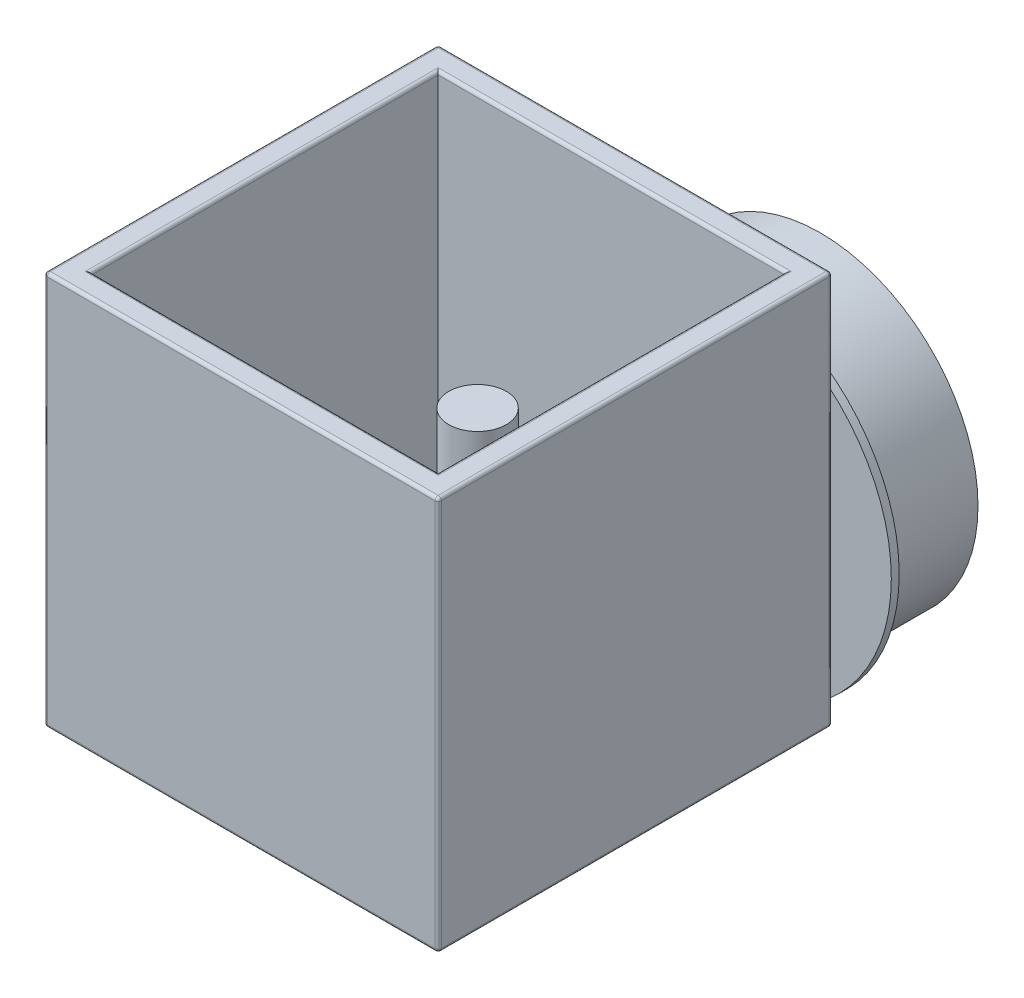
ISO-10303-21;
HEADER;
FILE_DESCRIPTION(('STEP AP214'),'2;1');
FILE_NAME('part.step','',(''),(''),'','','');
FILE_SCHEMA(('AUTOMOTIVE_DESIGN { 1 0 10303 214 1 1 1 1 }'));
ENDSEC;
DATA;
#1=APPLICATION_CONTEXT('core data for automotive mechanical design processes');
#2=APPLICATION_PROTOCOL_DEFINITION('international standard','automotive_design',2000,#1);
#3=PRODUCT_CONTEXT('',#1,'mechanical');
#4=PRODUCT('Part','Part','',(#3));
#5=PRODUCT_RELATED_PRODUCT_CATEGORY('part','',(#4));
#6=PRODUCT_DEFINITION_FORMATION('','',#4);
#7=PRODUCT_DEFINITION_CONTEXT('part definition',#1,'design');
#8=PRODUCT_DEFINITION('design','',#6,#7);
#9=PRODUCT_DEFINITION_SHAPE('','',#8);
#10=(LENGTH_UNIT() NAMED_UNIT(*) SI_UNIT(.MILLI.,.METRE.));
#11=(NAMED_UNIT(*) PLANE_ANGLE_UNIT() SI_UNIT($,.RADIAN.));
#12=(NAMED_UNIT(*) SI_UNIT($,.STERADIAN.) SOLID_ANGLE_UNIT());
#13=UNCERTAINTY_MEASURE_WITH_UNIT(LENGTH_MEASURE(1.E-05),#10,'distance_accuracy_value','');
#14=(GEOMETRIC_REPRESENTATION_CONTEXT(3) GLOBAL_UNCERTAINTY_ASSIGNED_CONTEXT((#13)) GLOBAL_UNIT_ASSIGNED_CONTEXT((#10,
#11,#12)) REPRESENTATION_CONTEXT('',''));
#15=CARTESIAN_POINT('',(0.,0.,0.));
#16=DIRECTION('',(0.,0.,1.));
#17=DIRECTION('',(1.,0.,0.));
#18=AXIS2_PLACEMENT_3D('',#15,#16,#17);
#19=CARTESIAN_POINT('',(-1.01424001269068,51.4911360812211,138.5));
#20=DIRECTION('',(0.,-1.,0.));
#21=DIRECTION('',(0.,0.,-1.));
#22=AXIS2_PLACEMENT_3D('',#19,#20,#21);
#23=CYLINDRICAL_SURFACE('',#22,7.31063902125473);
#24=CARTESIAN_POINT('',(-1.01424001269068,51.4911360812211,138.5));
#25=DIRECTION('',(0.,1.,0.));
#26=DIRECTION('',(0.,0.,1.));
#27=AXIS2_PLACEMENT_3D('',#24,#25,#26);
#28=CIRCLE('',#27,7.31063902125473);
#29=CARTESIAN_POINT('',(-1.01424001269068,51.4911360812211,145.810639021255));
#30=VERTEX_POINT('',#29);
#31=EDGE_CURVE('P0_E10',#30,#30,#28,.T.);
#32=ORIENTED_EDGE('',*,*,#31,.F.);
#33=EDGE_LOOP('',(#32));
#34=FACE_BOUND('',#33,.T.);
#35=CARTESIAN_POINT('',(-1.01424001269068,31.4911360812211,138.5));
#36=DIRECTION('',(0.,1.,0.));
#37=DIRECTION('',(0.,0.,1.));
#38=AXIS2_PLACEMENT_3D('',#35,#36,#37);
#39=CIRCLE('',#38,7.31063902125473);
#40=CARTESIAN_POINT('',(-1.01424001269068,31.4911360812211,145.810639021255));
#41=VERTEX_POINT('',#40);
#42=EDGE_CURVE('P0_E18',#41,#41,#39,.T.);
#43=ORIENTED_EDGE('',*,*,#42,.T.);
#44=EDGE_LOOP('',(#43));
#45=FACE_BOUND('',#44,.T.);
#46=ADVANCED_FACE('P0_F15',(#34,#45),#23,.T.);
#47=CARTESIAN_POINT('',(-1.01424001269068,51.4911360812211,138.5));
#48=DIRECTION('',(0.,1.,0.));
#49=DIRECTION('',(0.,0.,1.));
#50=AXIS2_PLACEMENT_3D('',#47,#48,#49);
#51=PLANE('',#50);
#52=ORIENTED_EDGE('',*,*,#31,.T.);
#53=EDGE_LOOP('',(#52));
#54=FACE_BOUND('',#53,.T.);
#55=ADVANCED_FACE('P0_F30',(#54),#51,.T.);
#56=CARTESIAN_POINT('',(-1.01424001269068,31.4911360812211,138.5));
#57=DIRECTION('',(0.,1.,0.));
#58=DIRECTION('',(0.,0.,1.));
#59=AXIS2_PLACEMENT_3D('',#56,#57,#58);
#60=PLANE('',#59);
#61=ORIENTED_EDGE('',*,*,#42,.F.);
#62=EDGE_LOOP('',(#61));
#63=FACE_BOUND('',#62,.T.);
#64=ADVANCED_FACE('P0_F28',(#63),#60,.F.);
#65=CLOSED_SHELL('',(#46,#55,#64));
#66=MANIFOLD_SOLID_BREP('P0_B1',#65);
#67=CARTESIAN_POINT('',(-1.01424001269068,6.49113608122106,98.5));
#68=DIRECTION('',(0.,0.,-1.));
#69=DIRECTION('',(0.,1.,0.));
#70=AXIS2_PLACEMENT_3D('',#67,#68,#69);
#71=PLANE('',#70);
#72=CARTESIAN_POINT('',(-1.01424001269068,6.49113608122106,98.5));
#73=DIRECTION('',(0.,0.,-1.));
#74=DIRECTION('',(0.,1.,0.));
#75=AXIS2_PLACEMENT_3D('',#72,#73,#74);
#76=CIRCLE('',#75,6.);
#77=CARTESIAN_POINT('',(-1.01424001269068,12.4911360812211,98.5));
#78=VERTEX_POINT('',#77);
#79=EDGE_CURVE('P1_E29',#78,#78,#76,.T.);
#80=ORIENTED_EDGE('',*,*,#79,.T.);
#81=EDGE_LOOP('',(#80));
#82=FACE_BOUND('',#81,.T.);
#83=ADVANCED_FACE('P1_F17',(#82),#71,.T.);
#84=CARTESIAN_POINT('',(-1.01424001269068,31.4911360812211,138.5));
#85=DIRECTION('',(0.,-1.,0.));
#86=DIRECTION('',(0.,0.,-1.));
#87=AXIS2_PLACEMENT_3D('',#84,#85,#86);
#88=PLANE('',#87);
#89=CARTESIAN_POINT('',(-1.01424001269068,31.4911360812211,138.5));
#90=DIRECTION('',(0.,-1.,0.));
#91=DIRECTION('',(0.,0.,-1.));
#92=AXIS2_PLACEMENT_3D('',#89,#90,#91);
#93=CIRCLE('',#92,6.);
#94=CARTESIAN_POINT('',(-1.01424001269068,31.4911360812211,132.5));
#95=VERTEX_POINT('',#94);
#96=EDGE_CURVE('P1_E11',#95,#95,#93,.T.);
#97=ORIENTED_EDGE('',*,*,#96,.F.);
#98=EDGE_LOOP('',(#97));
#99=FACE_BOUND('',#98,.T.);
#100=ADVANCED_FACE('P1_F35',(#99),#88,.F.);
#101=CARTESIAN_POINT('',(-1.01424001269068,6.49113608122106,98.5));
#102=DIRECTION('',(0.,0.,1.));
#103=DIRECTION('',(1.,0.,0.));
#104=AXIS2_PLACEMENT_3D('',#101,#102,#103);
#105=CYLINDRICAL_SURFACE('',#104,6.);
#106=CARTESIAN_POINT('',(-1.01424001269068,6.49113608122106,128.5));
#107=DIRECTION('',(0.,0.,-1.));
#108=DIRECTION('',(0.,1.,0.));
#109=AXIS2_PLACEMENT_3D('',#106,#107,#108);
#110=CIRCLE('',#109,6.);
#111=CARTESIAN_POINT('',(-1.01424001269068,0.491136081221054,128.5));
#112=VERTEX_POINT('',#111);
#113=EDGE_CURVE('P1_E61',#112,#112,#110,.T.);
#114=ORIENTED_EDGE('',*,*,#113,.T.);
#115=EDGE_LOOP('',(#114));
#116=FACE_BOUND('',#115,.T.);
#117=ORIENTED_EDGE('',*,*,#79,.F.);
#118=EDGE_LOOP('',(#117));
#119=FACE_BOUND('',#118,.T.);
#120=ADVANCED_FACE('P1_F37',(#116,#119),#105,.T.);
#121=CARTESIAN_POINT('',(-1.01424001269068,16.4911360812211,128.5));
#122=DIRECTION('',(-1.,0.,0.));
#123=DIRECTION('',(0.,0.,1.));
#124=AXIS2_PLACEMENT_3D('',#121,#122,#123);
#125=TOROIDAL_SURFACE('',#124,10.,6.);
#126=CARTESIAN_POINT('',(-1.01424001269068,16.4911360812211,138.5));
#127=DIRECTION('',(0.,-1.,0.));
#128=DIRECTION('',(0.,0.,-1.));
#129=AXIS2_PLACEMENT_3D('',#126,#127,#128);
#130=CIRCLE('',#129,6.);
#131=CARTESIAN_POINT('',(-1.01424001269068,16.4911360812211,144.5));
#132=VERTEX_POINT('',#131);
#133=EDGE_CURVE('P1_E24',#132,#132,#130,.T.);
#134=CARTESIAN_POINT('',(-1.01424001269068,16.4911360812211,128.5));
#135=DIRECTION('',(-1.,0.,0.));
#136=DIRECTION('',(0.,0.,1.));
#137=AXIS2_PLACEMENT_3D('',#134,#135,#136);
#138=CIRCLE('',#137,16.);
#139=EDGE_CURVE('',#112,#132,#138,.T.);
#140=ORIENTED_EDGE('',*,*,#113,.F.);
#141=ORIENTED_EDGE('',*,*,#133,.T.);
#142=ORIENTED_EDGE('',*,*,#139,.T.);
#143=ORIENTED_EDGE('',*,*,#139,.F.);
#144=EDGE_LOOP('',(#140,#142,#141,#143));
#145=FACE_BOUND('',#144,.T.);
#146=ADVANCED_FACE('P1_F43',(#145),#125,.T.);
#147=CARTESIAN_POINT('',(-1.01424001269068,16.4911360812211,138.5));
#148=DIRECTION('',(0.,1.,0.));
#149=DIRECTION('',(0.,0.,1.));
#150=AXIS2_PLACEMENT_3D('',#147,#148,#149);
#151=CYLINDRICAL_SURFACE('',#150,6.);
#152=ORIENTED_EDGE('',*,*,#96,.T.);
#153=EDGE_LOOP('',(#152));
#154=FACE_BOUND('',#153,.T.);
#155=ORIENTED_EDGE('',*,*,#133,.F.);
#156=EDGE_LOOP('',(#155));
#157=FACE_BOUND('',#156,.T.);
#158=ADVANCED_FACE('P1_F32',(#154,#157),#151,.T.);
#159=CLOSED_SHELL('',(#83,#100,#120,#146,#158));
#160=MANIFOLD_SOLID_BREP('P1_B1',#159);
#161=CARTESIAN_POINT('',(-1.01424001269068,6.49113608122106,97.));
#162=DIRECTION('',(0.,0.,1.));
#163=DIRECTION('',(1.,0.,0.));
#164=AXIS2_PLACEMENT_3D('',#161,#162,#163);
#165=CYLINDRICAL_SURFACE('',#164,15.);
#166=CARTESIAN_POINT('',(-1.01424001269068,6.49113608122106,97.));
#167=DIRECTION('',(0.,0.,1.));
#168=DIRECTION('',(1.,0.,0.));
#169=AXIS2_PLACEMENT_3D('',#166,#167,#168);
#170=CIRCLE('',#169,15.);
#171=CARTESIAN_POINT('',(13.9857599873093,6.49113608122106,97.));
#172=VERTEX_POINT('',#171);
#173=EDGE_CURVE('P2_E10',#172,#172,#170,.T.);
#174=ORIENTED_EDGE('',*,*,#173,.T.);
#175=EDGE_LOOP('',(#174));
#176=FACE_BOUND('',#175,.T.);
#177=CARTESIAN_POINT('',(-1.01424001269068,6.49113608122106,98.5));
#178=DIRECTION('',(0.,0.,1.));
#179=DIRECTION('',(1.,0.,0.));
#180=AXIS2_PLACEMENT_3D('',#177,#178,#179);
#181=CIRCLE('',#180,15.);
#182=CARTESIAN_POINT('',(13.9857599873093,6.49113608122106,98.5));
#183=VERTEX_POINT('',#182);
#184=EDGE_CURVE('P2_E18',#183,#183,#181,.T.);
#185=ORIENTED_EDGE('',*,*,#184,.F.);
#186=EDGE_LOOP('',(#185));
#187=FACE_BOUND('',#186,.T.);
#188=ADVANCED_FACE('P2_F15',(#176,#187),#165,.T.);
#189=CARTESIAN_POINT('',(-1.01424001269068,6.49113608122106,97.));
#190=DIRECTION('',(0.,0.,1.));
#191=DIRECTION('',(1.,0.,0.));
#192=AXIS2_PLACEMENT_3D('',#189,#190,#191);
#193=PLANE('',#192);
#194=CARTESIAN_POINT('',(-1.01424001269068,6.49113608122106,97.));
#195=DIRECTION('',(0.,0.,1.));
#196=DIRECTION('',(1.,0.,0.));
#197=AXIS2_PLACEMENT_3D('',#194,#195,#196);
#198=CIRCLE('',#197,7.);
#199=CARTESIAN_POINT('',(5.98575998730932,6.49113608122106,97.));
#200=VERTEX_POINT('',#199);
#201=EDGE_CURVE('P2_E25',#200,#200,#198,.T.);
#202=ORIENTED_EDGE('',*,*,#201,.T.);
#203=EDGE_LOOP('',(#202));
#204=FACE_BOUND('',#203,.T.);
#205=ORIENTED_EDGE('',*,*,#173,.F.);
#206=EDGE_LOOP('',(#205));
#207=FACE_BOUND('',#206,.T.);
#208=ADVANCED_FACE('P2_F33',(#204,#207),#193,.F.);
#209=CARTESIAN_POINT('',(-1.01424001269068,6.49113608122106,98.5));
#210=DIRECTION('',(0.,0.,1.));
#211=DIRECTION('',(1.,0.,0.));
#212=AXIS2_PLACEMENT_3D('',#209,#210,#211);
#213=PLANE('',#212);
#214=CARTESIAN_POINT('',(-1.01424001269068,6.49113608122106,98.5));
#215=DIRECTION('',(0.,0.,1.));
#216=DIRECTION('',(1.,0.,0.));
#217=AXIS2_PLACEMENT_3D('',#214,#215,#216);
#218=CIRCLE('',#217,7.);
#219=CARTESIAN_POINT('',(5.98575998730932,6.49113608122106,98.5));
#220=VERTEX_POINT('',#219);
#221=EDGE_CURVE('P2_E27',#220,#220,#218,.T.);
#222=ORIENTED_EDGE('',*,*,#221,.F.);
#223=EDGE_LOOP('',(#222));
#224=FACE_BOUND('',#223,.T.);
#225=ORIENTED_EDGE('',*,*,#184,.T.);
#226=EDGE_LOOP('',(#225));
#227=FACE_BOUND('',#226,.T.);
#228=ADVANCED_FACE('P2_F39',(#224,#227),#213,.T.);
#229=CARTESIAN_POINT('',(-1.01424001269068,6.49113608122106,97.));
#230=DIRECTION('',(0.,0.,1.));
#231=DIRECTION('',(1.,0.,0.));
#232=AXIS2_PLACEMENT_3D('',#229,#230,#231);
#233=CYLINDRICAL_SURFACE('',#232,7.);
#234=ORIENTED_EDGE('',*,*,#201,.F.);
#235=EDGE_LOOP('',(#234));
#236=FACE_BOUND('',#235,.T.);
#237=ORIENTED_EDGE('',*,*,#221,.T.);
#238=EDGE_LOOP('',(#237));
#239=FACE_BOUND('',#238,.T.);
#240=ADVANCED_FACE('P2_F36',(#236,#239),#233,.F.);
#241=CLOSED_SHELL('',(#188,#208,#228,#240));
#242=MANIFOLD_SOLID_BREP('P2_B1',#241);
#243=CARTESIAN_POINT('',(-1.01424001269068,6.49113608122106,76.5));
#244=DIRECTION('',(0.,0.,-1.));
#245=DIRECTION('',(-1.,0.,0.));
#246=AXIS2_PLACEMENT_3D('',#243,#244,#245);
#247=CYLINDRICAL_SURFACE('',#246,40.);
#248=CARTESIAN_POINT('',(-1.01424001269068,6.49113608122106,76.5));
#249=DIRECTION('',(0.,0.,1.));
#250=DIRECTION('',(1.,0.,0.));
#251=AXIS2_PLACEMENT_3D('',#248,#249,#250);
#252=CIRCLE('',#251,40.);
#253=CARTESIAN_POINT('',(38.9857599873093,6.49113608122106,76.5));
#254=VERTEX_POINT('',#253);
#255=EDGE_CURVE('P3_E22',#254,#254,#252,.T.);
#256=ORIENTED_EDGE('',*,*,#255,.F.);
#257=EDGE_LOOP('',(#256));
#258=FACE_BOUND('',#257,.T.);
#259=CARTESIAN_POINT('',(-1.01424001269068,6.49113608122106,51.5));
#260=DIRECTION('',(0.,0.,1.));
#261=DIRECTION('',(1.,0.,0.));
#262=AXIS2_PLACEMENT_3D('',#259,#260,#261);
#263=CIRCLE('',#262,40.);
#264=CARTESIAN_POINT('',(38.9857599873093,6.49113608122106,51.5));
#265=VERTEX_POINT('',#264);
#266=EDGE_CURVE('P3_E18',#265,#265,#263,.T.);
#267=ORIENTED_EDGE('',*,*,#266,.T.);
#268=EDGE_LOOP('',(#267));
#269=FACE_BOUND('',#268,.T.);
#270=ADVANCED_FACE('P3_F15',(#258,#269),#247,.T.);
#271=CARTESIAN_POINT('',(-1.01424001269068,6.49113608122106,51.5));
#272=DIRECTION('',(0.,0.,1.));
#273=DIRECTION('',(1.,0.,0.));
#274=AXIS2_PLACEMENT_3D('',#271,#272,#273);
#275=PLANE('',#274);
#276=ORIENTED_EDGE('',*,*,#266,.F.);
#277=EDGE_LOOP('',(#276));
#278=FACE_BOUND('',#277,.T.);
#279=ADVANCED_FACE('P3_F57',(#278),#275,.F.);
#280=CARTESIAN_POINT('',(-1.01424001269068,6.49113608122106,78.5));
#281=DIRECTION('',(0.,0.,-1.));
#282=DIRECTION('',(-1.,0.,0.));
#283=AXIS2_PLACEMENT_3D('',#280,#281,#282);
#284=CYLINDRICAL_SURFACE('',#283,45.);
#285=CARTESIAN_POINT('',(-1.01424001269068,6.49113608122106,78.5));
#286=DIRECTION('',(0.,0.,1.));
#287=DIRECTION('',(1.,0.,0.));
#288=AXIS2_PLACEMENT_3D('',#285,#286,#287);
#289=CIRCLE('',#288,45.);
#290=CARTESIAN_POINT('',(43.9857599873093,6.49113608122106,78.5));
#291=VERTEX_POINT('',#290);
#292=EDGE_CURVE('P3_E30',#291,#291,#289,.T.);
#293=ORIENTED_EDGE('',*,*,#292,.F.);
#294=EDGE_LOOP('',(#293));
#295=FACE_BOUND('',#294,.T.);
#296=CARTESIAN_POINT('',(-1.01424001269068,6.49113608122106,76.5));
#297=DIRECTION('',(0.,0.,1.));
#298=DIRECTION('',(1.,0.,0.));
#299=AXIS2_PLACEMENT_3D('',#296,#297,#298);
#300=CIRCLE('',#299,45.);
#301=CARTESIAN_POINT('',(43.9857599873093,6.49113608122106,76.5));
#302=VERTEX_POINT('',#301);
#303=EDGE_CURVE('P3_E33',#302,#302,#300,.T.);
#304=ORIENTED_EDGE('',*,*,#303,.T.);
#305=EDGE_LOOP('',(#304));
#306=FACE_BOUND('',#305,.T.);
#307=ADVANCED_FACE('P3_F62',(#295,#306),#284,.T.);
#308=CARTESIAN_POINT('',(-1.01424001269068,6.49113608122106,78.5));
#309=DIRECTION('',(0.,0.,1.));
#310=DIRECTION('',(1.,0.,0.));
#311=AXIS2_PLACEMENT_3D('',#308,#309,#310);
#312=PLANE('',#311);
#313=CARTESIAN_POINT('',(-1.01424001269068,6.49113608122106,78.5));
#314=DIRECTION('',(0.,0.,1.));
#315=DIRECTION('',(1.,0.,0.));
#316=AXIS2_PLACEMENT_3D('',#313,#314,#315);
#317=CIRCLE('',#316,7.);
#318=CARTESIAN_POINT('',(5.98575998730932,6.49113608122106,78.5));
#319=VERTEX_POINT('',#318);
#320=EDGE_CURVE('P3_E10',#319,#319,#317,.T.);
#321=ORIENTED_EDGE('',*,*,#320,.F.);
#322=EDGE_LOOP('',(#321));
#323=FACE_BOUND('',#322,.T.);
#324=ORIENTED_EDGE('',*,*,#292,.T.);
#325=EDGE_LOOP('',(#324));
#326=FACE_BOUND('',#325,.T.);
#327=ADVANCED_FACE('P3_F52',(#323,#326),#312,.T.);
#328=CARTESIAN_POINT('',(-1.01424001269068,6.49113608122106,76.5));
#329=DIRECTION('',(0.,0.,1.));
#330=DIRECTION('',(1.,0.,0.));
#331=AXIS2_PLACEMENT_3D('',#328,#329,#330);
#332=PLANE('',#331);
#333=ORIENTED_EDGE('',*,*,#255,.T.);
#334=EDGE_LOOP('',(#333));
#335=FACE_BOUND('',#334,.T.);
#336=ORIENTED_EDGE('',*,*,#303,.F.);
#337=EDGE_LOOP('',(#336));
#338=FACE_BOUND('',#337,.T.);
#339=ADVANCED_FACE('P3_F44',(#335,#338),#332,.F.);
#340=CARTESIAN_POINT('',(-1.01424001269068,6.49113608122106,98.5));
#341=DIRECTION('',(0.,0.,-1.));
#342=DIRECTION('',(-1.,0.,0.));
#343=AXIS2_PLACEMENT_3D('',#340,#341,#342);
#344=CYLINDRICAL_SURFACE('',#343,7.);
#345=CARTESIAN_POINT('',(-1.01424001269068,6.49113608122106,98.5));
#346=DIRECTION('',(0.,0.,1.));
#347=DIRECTION('',(1.,0.,0.));
#348=AXIS2_PLACEMENT_3D('',#345,#346,#347);
#349=CIRCLE('',#348,7.);
#350=CARTESIAN_POINT('',(5.98575998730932,6.49113608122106,98.5));
#351=VERTEX_POINT('',#350);
#352=EDGE_CURVE('P3_E29',#351,#351,#349,.T.);
#353=ORIENTED_EDGE('',*,*,#352,.F.);
#354=EDGE_LOOP('',(#353));
#355=FACE_BOUND('',#354,.T.);
#356=ORIENTED_EDGE('',*,*,#320,.T.);
#357=EDGE_LOOP('',(#356));
#358=FACE_BOUND('',#357,.T.);
#359=ADVANCED_FACE('P3_F42',(#355,#358),#344,.T.);
#360=CARTESIAN_POINT('',(-1.01424001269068,6.49113608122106,98.5));
#361=DIRECTION('',(0.,0.,1.));
#362=DIRECTION('',(1.,0.,0.));
#363=AXIS2_PLACEMENT_3D('',#360,#361,#362);
#364=PLANE('',#363);
#365=ORIENTED_EDGE('',*,*,#352,.T.);
#366=EDGE_LOOP('',(#365));
#367=FACE_BOUND('',#366,.T.);
#368=ADVANCED_FACE('P3_F40',(#367),#364,.T.);
#369=CLOSED_SHELL('',(#270,#279,#307,#327,#339,#359,#368));
#370=MANIFOLD_SOLID_BREP('P3_B1',#369);
#371=CARTESIAN_POINT('',(-51.0140505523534,86.4912544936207,98.5000000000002));
#372=DIRECTION('',(-2.3682524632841E-06,-0.999999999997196,0.));
#373=DIRECTION('',(0.,0.,-1.));
#374=AXIS2_PLACEMENT_3D('',#371,#372,#373);
#375=PLANE('',#374);
#376=DIRECTION('',(0.999999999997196,-2.3682524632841E-06,0.));
#377=VECTOR('',#376,1.);
#378=CARTESIAN_POINT('',(42.985949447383,86.4910318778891,103.7));
#379=LINE('',#378,#377);
#380=CARTESIAN_POINT('',(-45.814050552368,86.4912421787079,103.7));
#381=VERTEX_POINT('',#380);
#382=CARTESIAN_POINT('',(43.7859494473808,86.4910299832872,103.7));
#383=VERTEX_POINT('',#382);
#384=EDGE_CURVE('P4_E208',#381,#383,#379,.T.);
#385=ORIENTED_EDGE('',*,*,#384,.T.);
#386=DIRECTION('',(0.,0.,1.));
#387=VECTOR('',#386,1.);
#388=CARTESIAN_POINT('',(43.7859494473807,86.491029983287,192.5));
#389=LINE('',#388,#387);
#390=CARTESIAN_POINT('',(43.7859494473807,86.491029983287,193.3));
#391=VERTEX_POINT('',#390);
#392=EDGE_CURVE('P4_E210',#383,#391,#389,.T.);
#393=ORIENTED_EDGE('',*,*,#392,.T.);
#394=DIRECTION('',(0.999999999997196,-2.3682524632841E-06,0.));
#395=VECTOR('',#394,1.);
#396=CARTESIAN_POINT('',(-51.0140505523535,86.4912544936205,193.3));
#397=LINE('',#396,#395);
#398=CARTESIAN_POINT('',(-45.8140505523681,86.4912421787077,193.3));
#399=VERTEX_POINT('',#398);
#400=EDGE_CURVE('P4_E204',#391,#399,#397,.F.);
#401=ORIENTED_EDGE('',*,*,#400,.T.);
#402=DIRECTION('',(0.,0.,1.));
#403=VECTOR('',#402,1.);
#404=CARTESIAN_POINT('',(-45.814050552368,86.4912421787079,104.5));
#405=LINE('',#404,#403);
#406=EDGE_CURVE('P4_E206',#399,#381,#405,.F.);
#407=ORIENTED_EDGE('',*,*,#406,.T.);
#408=EDGE_LOOP('',(#385,#393,#401,#407));
#409=FACE_BOUND('',#408,.T.);
#410=DIRECTION('',(0.,0.,1.));
#411=VECTOR('',#410,1.);
#412=CARTESIAN_POINT('',(48.1859494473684,86.4910195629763,98.5000000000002));
#413=LINE('',#412,#411);
#414=CARTESIAN_POINT('',(48.1859494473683,86.4910195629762,197.7));
#415=VERTEX_POINT('',#414);
#416=CARTESIAN_POINT('',(48.1859494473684,86.4910195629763,99.3000000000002));
#417=VERTEX_POINT('',#416);
#418=EDGE_CURVE('P4_E199',#415,#417,#413,.F.);
#419=ORIENTED_EDGE('',*,*,#418,.T.);
#420=DIRECTION('',(0.999999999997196,-2.3682524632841E-06,0.));
#421=VECTOR('',#420,1.);
#422=CARTESIAN_POINT('',(-51.0140505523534,86.4912544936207,99.3000000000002));
#423=LINE('',#422,#421);
#424=CARTESIAN_POINT('',(-50.2140505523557,86.4912525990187,99.3000000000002));
#425=VERTEX_POINT('',#424);
#426=EDGE_CURVE('P4_E201',#417,#425,#423,.F.);
#427=ORIENTED_EDGE('',*,*,#426,.T.);
#428=DIRECTION('',(0.,0.,1.));
#429=VECTOR('',#428,1.);
#430=CARTESIAN_POINT('',(-50.2140505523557,86.4912525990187,98.5000000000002));
#431=LINE('',#430,#429);
#432=CARTESIAN_POINT('',(-50.2140505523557,86.4912525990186,197.7));
#433=VERTEX_POINT('',#432);
#434=EDGE_CURVE('P4_E197',#425,#433,#431,.T.);
#435=ORIENTED_EDGE('',*,*,#434,.T.);
#436=DIRECTION('',(0.999999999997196,-2.3682524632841E-06,0.));
#437=VECTOR('',#436,1.);
#438=CARTESIAN_POINT('',(48.9859494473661,86.4910176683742,197.7));
#439=LINE('',#438,#437);
#440=EDGE_CURVE('P4_E195',#433,#415,#439,.T.);
#441=ORIENTED_EDGE('',*,*,#440,.T.);
#442=EDGE_LOOP('',(#419,#427,#435,#441));
#443=FACE_BOUND('',#442,.T.);
#444=ADVANCED_FACE('P4_F16',(#409,#443),#375,.F.);
#445=CARTESIAN_POINT('',(48.9859494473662,86.4910176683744,98.5000000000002));
#446=DIRECTION('',(-0.999999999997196,2.3682524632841E-06,0.));
#447=DIRECTION('',(0.,0.,-1.));
#448=AXIS2_PLACEMENT_3D('',#445,#446,#447);
#449=PLANE('',#448);
#450=DIRECTION('',(0.,0.,1.));
#451=VECTOR('',#450,1.);
#452=CARTESIAN_POINT('',(48.9857145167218,-12.7089823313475,98.5000000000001));
#453=LINE('',#452,#451);
#454=CARTESIAN_POINT('',(48.9857145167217,-12.7089823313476,197.7));
#455=VERTEX_POINT('',#454);
#456=CARTESIAN_POINT('',(48.9857145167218,-12.7089823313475,99.3000000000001));
#457=VERTEX_POINT('',#456);
#458=EDGE_CURVE('P4_E186',#455,#457,#453,.F.);
#459=ORIENTED_EDGE('',*,*,#458,.T.);
#460=DIRECTION('',(-2.3682524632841E-06,-0.999999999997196,0.));
#461=VECTOR('',#460,1.);
#462=CARTESIAN_POINT('',(48.9859494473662,86.4910176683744,99.3000000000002));
#463=LINE('',#462,#461);
#464=CARTESIAN_POINT('',(48.9859475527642,85.6910176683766,99.3000000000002));
#465=VERTEX_POINT('',#464);
#466=EDGE_CURVE('P4_E192',#457,#465,#463,.F.);
#467=ORIENTED_EDGE('',*,*,#466,.T.);
#468=DIRECTION('',(0.,0.,1.));
#469=VECTOR('',#468,1.);
#470=CARTESIAN_POINT('',(48.9859475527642,85.6910176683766,98.5000000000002));
#471=LINE('',#470,#469);
#472=CARTESIAN_POINT('',(48.9859475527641,85.6910176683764,197.7));
#473=VERTEX_POINT('',#472);
#474=EDGE_CURVE('P4_E190',#465,#473,#471,.T.);
#475=ORIENTED_EDGE('',*,*,#474,.T.);
#476=DIRECTION('',(-2.3682524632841E-06,-0.999999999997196,0.));
#477=VECTOR('',#476,1.);
#478=CARTESIAN_POINT('',(48.9857126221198,-13.5089823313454,197.7));
#479=LINE('',#478,#477);
#480=EDGE_CURVE('P4_E188',#473,#455,#479,.T.);
#481=ORIENTED_EDGE('',*,*,#480,.T.);
#482=EDGE_LOOP('',(#459,#467,#475,#481));
#483=FACE_BOUND('',#482,.T.);
#484=ADVANCED_FACE('P4_F340',(#483),#449,.F.);
#485=CARTESIAN_POINT('',(-51.0142873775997,-13.5087455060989,98.5));
#486=DIRECTION('',(2.3682524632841E-06,0.999999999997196,0.));
#487=DIRECTION('',(0.,0.,1.));
#488=AXIS2_PLACEMENT_3D('',#485,#486,#487);
#489=PLANE('',#488);
#490=DIRECTION('',(-0.999999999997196,2.3682524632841E-06,0.));
#491=VECTOR('',#490,1.);
#492=CARTESIAN_POINT('',(-51.0142873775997,-13.5087455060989,99.3));
#493=LINE('',#492,#491);
#494=CARTESIAN_POINT('',(-50.214287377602,-13.5087474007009,99.3));
#495=VERTEX_POINT('',#494);
#496=CARTESIAN_POINT('',(48.1857126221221,-13.5089804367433,99.3000000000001));
#497=VERTEX_POINT('',#496);
#498=EDGE_CURVE('P4_E25',#495,#497,#493,.F.);
#499=ORIENTED_EDGE('',*,*,#498,.T.);
#500=DIRECTION('',(0.,0.,1.));
#501=VECTOR('',#500,1.);
#502=CARTESIAN_POINT('',(48.1857126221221,-13.5089804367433,98.5000000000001));
#503=LINE('',#502,#501);
#504=CARTESIAN_POINT('',(48.185712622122,-13.5089804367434,197.7));
#505=VERTEX_POINT('',#504);
#506=EDGE_CURVE('P4_E10',#497,#505,#503,.T.);
#507=ORIENTED_EDGE('',*,*,#506,.T.);
#508=DIRECTION('',(-0.999999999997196,2.3682524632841E-06,0.));
#509=VECTOR('',#508,1.);
#510=CARTESIAN_POINT('',(-51.0142873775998,-13.5087455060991,197.7));
#511=LINE('',#510,#509);
#512=CARTESIAN_POINT('',(-50.2142873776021,-13.508747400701,197.7));
#513=VERTEX_POINT('',#512);
#514=EDGE_CURVE('P4_E239',#505,#513,#511,.T.);
#515=ORIENTED_EDGE('',*,*,#514,.T.);
#516=DIRECTION('',(0.,0.,1.));
#517=VECTOR('',#516,1.);
#518=CARTESIAN_POINT('',(-50.214287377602,-13.5087474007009,98.5));
#519=LINE('',#518,#517);
#520=EDGE_CURVE('P4_E36',#513,#495,#519,.F.);
#521=ORIENTED_EDGE('',*,*,#520,.T.);
#522=EDGE_LOOP('',(#499,#507,#515,#521));
#523=FACE_BOUND('',#522,.T.);
#524=ADVANCED_FACE('P4_F697',(#523),#489,.F.);
#525=CARTESIAN_POINT('',(-51.0140505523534,86.4912544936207,98.5000000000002));
#526=DIRECTION('',(0.999999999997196,-2.3682524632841E-06,0.));
#527=DIRECTION('',(0.,0.,1.));
#528=AXIS2_PLACEMENT_3D('',#525,#526,#527);
#529=PLANE('',#528);
#530=DIRECTION('',(0.,0.,1.));
#531=VECTOR('',#530,1.);
#532=CARTESIAN_POINT('',(-51.0140524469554,85.6912544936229,98.5000000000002));
#533=LINE('',#532,#531);
#534=CARTESIAN_POINT('',(-51.0140524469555,85.6912544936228,197.7));
#535=VERTEX_POINT('',#534);
#536=CARTESIAN_POINT('',(-51.0140524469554,85.6912544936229,99.3000000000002));
#537=VERTEX_POINT('',#536);
#538=EDGE_CURVE('P4_E225',#535,#537,#533,.F.);
#539=ORIENTED_EDGE('',*,*,#538,.T.);
#540=DIRECTION('',(2.3682524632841E-06,0.999999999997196,0.));
#541=VECTOR('',#540,1.);
#542=CARTESIAN_POINT('',(-51.0140505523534,86.4912544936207,99.3000000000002));
#543=LINE('',#542,#541);
#544=CARTESIAN_POINT('',(-51.0142854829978,-12.7087455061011,99.3));
#545=VERTEX_POINT('',#544);
#546=EDGE_CURVE('P4_E227',#537,#545,#543,.F.);
#547=ORIENTED_EDGE('',*,*,#546,.T.);
#548=DIRECTION('',(0.,0.,1.));
#549=VECTOR('',#548,1.);
#550=CARTESIAN_POINT('',(-51.0142854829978,-12.7087455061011,98.5));
#551=LINE('',#550,#549);
#552=CARTESIAN_POINT('',(-51.0142854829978,-12.7087455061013,197.7));
#553=VERTEX_POINT('',#552);
#554=EDGE_CURVE('P4_E221',#545,#553,#551,.T.);
#555=ORIENTED_EDGE('',*,*,#554,.T.);
#556=DIRECTION('',(2.3682524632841E-06,0.999999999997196,0.));
#557=VECTOR('',#556,1.);
#558=CARTESIAN_POINT('',(-51.0140505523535,86.4912544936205,197.7));
#559=LINE('',#558,#557);
#560=EDGE_CURVE('P4_E223',#553,#535,#559,.T.);
#561=ORIENTED_EDGE('',*,*,#560,.T.);
#562=EDGE_LOOP('',(#539,#547,#555,#561));
#563=FACE_BOUND('',#562,.T.);
#564=ADVANCED_FACE('P4_F416',(#563),#529,.F.);
#565=CARTESIAN_POINT('',(-1.01416896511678,36.4911360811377,98.5000000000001));
#566=DIRECTION('',(0.,0.,1.));
#567=DIRECTION('',(-0.999999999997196,2.3682524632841E-06,0.));
#568=AXIS2_PLACEMENT_3D('',#565,#566,#567);
#569=PLANE('',#568);
#570=DIRECTION('',(0.999999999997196,-2.3682524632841E-06,0.));
#571=VECTOR('',#570,1.);
#572=CARTESIAN_POINT('',(-1.01405244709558,85.6911360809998,98.5000000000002));
#573=LINE('',#572,#571);
#574=CARTESIAN_POINT('',(-50.2140524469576,85.691252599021,98.5000000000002));
#575=VERTEX_POINT('',#574);
#576=CARTESIAN_POINT('',(48.1859475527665,85.6910195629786,98.5000000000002));
#577=VERTEX_POINT('',#576);
#578=EDGE_CURVE('P4_E181',#575,#577,#573,.T.);
#579=ORIENTED_EDGE('',*,*,#578,.T.);
#580=DIRECTION('',(-2.3682524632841E-06,-0.999999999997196,0.));
#581=VECTOR('',#580,1.);
#582=CARTESIAN_POINT('',(48.1858310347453,36.4910195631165,98.5000000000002));
#583=LINE('',#582,#581);
#584=CARTESIAN_POINT('',(48.1857145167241,-12.7089804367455,98.5000000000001));
#585=VERTEX_POINT('',#584);
#586=EDGE_CURVE('P4_E183',#577,#585,#583,.T.);
#587=ORIENTED_EDGE('',*,*,#586,.T.);
#588=DIRECTION('',(-0.999999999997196,2.3682524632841E-06,0.));
#589=VECTOR('',#588,1.);
#590=CARTESIAN_POINT('',(-1.01428548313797,-12.7088639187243,98.5));
#591=LINE('',#590,#589);
#592=CARTESIAN_POINT('',(-50.214285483,-12.7087474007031,98.5));
#593=VERTEX_POINT('',#592);
#594=EDGE_CURVE('P4_E177',#585,#593,#591,.T.);
#595=ORIENTED_EDGE('',*,*,#594,.T.);
#596=DIRECTION('',(2.3682524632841E-06,0.999999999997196,0.));
#597=VECTOR('',#596,1.);
#598=CARTESIAN_POINT('',(-50.2141689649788,36.4912525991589,98.5000000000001));
#599=LINE('',#598,#597);
#600=EDGE_CURVE('P4_E179',#593,#575,#599,.T.);
#601=ORIENTED_EDGE('',*,*,#600,.T.);
#602=EDGE_LOOP('',(#579,#587,#595,#601));
#603=FACE_BOUND('',#602,.T.);
#604=CARTESIAN_POINT('',(-1.01424001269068,6.49113608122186,98.5000000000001));
#605=DIRECTION('',(0.,0.,-1.));
#606=DIRECTION('',(0.999999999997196,-2.3682524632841E-06,0.));
#607=AXIS2_PLACEMENT_3D('',#604,#605,#606);
#608=CIRCLE('',#607,7.);
#609=CARTESIAN_POINT('',(5.98575998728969,6.49111950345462,98.5000000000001));
#610=VERTEX_POINT('',#609);
#611=EDGE_CURVE('P4_E176',#610,#610,#608,.T.);
#612=ORIENTED_EDGE('',*,*,#611,.F.);
#613=EDGE_LOOP('',(#612));
#614=FACE_BOUND('',#613,.T.);
#615=ADVANCED_FACE('P4_F364',(#603,#614),#569,.F.);
#616=CARTESIAN_POINT('',(-1.01416896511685,36.4911360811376,198.5));
#617=DIRECTION('',(0.,0.,1.));
#618=DIRECTION('',(-0.999999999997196,2.3682524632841E-06,0.));
#619=AXIS2_PLACEMENT_3D('',#616,#617,#618);
#620=PLANE('',#619);
#621=DIRECTION('',(0.999999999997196,-2.3682524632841E-06,0.));
#622=VECTOR('',#621,1.);
#623=CARTESIAN_POINT('',(-51.0140524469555,85.6912544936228,198.5));
#624=LINE('',#623,#622);
#625=CARTESIAN_POINT('',(48.1859475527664,85.6910195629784,198.5));
#626=VERTEX_POINT('',#625);
#627=CARTESIAN_POINT('',(-50.2140524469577,85.6912525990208,198.5));
#628=VERTEX_POINT('',#627);
#629=EDGE_CURVE('P4_E234',#626,#628,#624,.F.);
#630=ORIENTED_EDGE('',*,*,#629,.T.);
#631=DIRECTION('',(2.3682524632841E-06,0.999999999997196,0.));
#632=VECTOR('',#631,1.);
#633=CARTESIAN_POINT('',(-50.2142873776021,-13.508747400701,198.5));
#634=LINE('',#633,#632);
#635=CARTESIAN_POINT('',(-50.2142854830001,-12.7087474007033,198.5));
#636=VERTEX_POINT('',#635);
#637=EDGE_CURVE('P4_E236',#628,#636,#634,.F.);
#638=ORIENTED_EDGE('',*,*,#637,.T.);
#639=DIRECTION('',(-0.999999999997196,2.3682524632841E-06,0.));
#640=VECTOR('',#639,1.);
#641=CARTESIAN_POINT('',(48.9857145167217,-12.7089823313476,198.5));
#642=LINE('',#641,#640);
#643=CARTESIAN_POINT('',(48.185714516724,-12.7089804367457,198.5));
#644=VERTEX_POINT('',#643);
#645=EDGE_CURVE('P4_E230',#636,#644,#642,.F.);
#646=ORIENTED_EDGE('',*,*,#645,.T.);
#647=DIRECTION('',(-2.3682524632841E-06,-0.999999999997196,0.));
#648=VECTOR('',#647,1.);
#649=CARTESIAN_POINT('',(48.1859494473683,86.4910195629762,198.5));
#650=LINE('',#649,#648);
#651=EDGE_CURVE('P4_E232',#644,#626,#650,.F.);
#652=ORIENTED_EDGE('',*,*,#651,.T.);
#653=EDGE_LOOP('',(#630,#638,#646,#652));
#654=FACE_BOUND('',#653,.T.);
#655=ADVANCED_FACE('P4_F422',(#654),#620,.T.);
#656=CARTESIAN_POINT('',(42.985949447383,86.4910318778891,98.5000000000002));
#657=DIRECTION('',(-0.999999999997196,2.3682524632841E-06,0.));
#658=DIRECTION('',(0.,0.,-1.));
#659=AXIS2_PLACEMENT_3D('',#656,#657,#658);
#660=PLANE('',#659);
#661=DIRECTION('',(-2.3682524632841E-06,-0.999999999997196,0.));
#662=VECTOR('',#661,1.);
#663=CARTESIAN_POINT('',(42.9858310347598,36.4910318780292,192.5));
#664=LINE('',#663,#662);
#665=CARTESIAN_POINT('',(42.985947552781,85.6910318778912,192.5));
#666=VERTEX_POINT('',#665);
#667=CARTESIAN_POINT('',(42.9857268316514,-7.50896812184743,192.5));
#668=VERTEX_POINT('',#667);
#669=EDGE_CURVE('P4_E148',#666,#668,#664,.T.);
#670=ORIENTED_EDGE('',*,*,#669,.F.);
#671=DIRECTION('',(0.,0.,1.));
#672=VECTOR('',#671,1.);
#673=CARTESIAN_POINT('',(42.985947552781,85.6910318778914,104.5));
#674=LINE('',#673,#672);
#675=CARTESIAN_POINT('',(42.985947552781,85.6910318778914,104.5));
#676=VERTEX_POINT('',#675);
#677=EDGE_CURVE('P4_E213',#666,#676,#674,.F.);
#678=ORIENTED_EDGE('',*,*,#677,.T.);
#679=DIRECTION('',(-2.3682524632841E-06,-0.999999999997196,0.));
#680=VECTOR('',#679,1.);
#681=CARTESIAN_POINT('',(42.9858310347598,36.4910318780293,104.5));
#682=LINE('',#681,#680);
#683=CARTESIAN_POINT('',(42.9857268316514,-7.50896812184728,104.5));
#684=VERTEX_POINT('',#683);
#685=EDGE_CURVE('P4_E167',#676,#684,#682,.T.);
#686=ORIENTED_EDGE('',*,*,#685,.T.);
#687=DIRECTION('',(0.,0.,1.));
#688=VECTOR('',#687,1.);
#689=CARTESIAN_POINT('',(42.9857268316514,-7.50896812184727,98.5000000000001));
#690=LINE('',#689,#688);
#691=EDGE_CURVE('P4_E161',#684,#668,#690,.T.);
#692=ORIENTED_EDGE('',*,*,#691,.T.);
#693=EDGE_LOOP('',(#670,#678,#686,#692));
#694=FACE_BOUND('',#693,.T.);
#695=ADVANCED_FACE('P4_F331',(#694),#660,.T.);
#696=CARTESIAN_POINT('',(-51.014273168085,-7.50874550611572,98.5));
#697=DIRECTION('',(2.3682524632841E-06,0.999999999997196,0.));
#698=DIRECTION('',(0.,0.,1.));
#699=AXIS2_PLACEMENT_3D('',#696,#697,#698);
#700=PLANE('',#699);
#701=DIRECTION('',(-0.999999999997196,2.3682524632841E-06,0.));
#702=VECTOR('',#701,1.);
#703=CARTESIAN_POINT('',(-1.01427316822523,-7.50886391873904,192.5));
#704=LINE('',#703,#702);
#705=CARTESIAN_POINT('',(-45.0142731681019,-7.50875971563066,192.5));
#706=VERTEX_POINT('',#705);
#707=EDGE_CURVE('P4_E141',#668,#706,#704,.T.);
#708=ORIENTED_EDGE('',*,*,#707,.F.);
#709=ORIENTED_EDGE('',*,*,#691,.F.);
#710=DIRECTION('',(-0.999999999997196,2.3682524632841E-06,0.));
#711=VECTOR('',#710,1.);
#712=CARTESIAN_POINT('',(-1.01427316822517,-7.50886391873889,104.5));
#713=LINE('',#712,#711);
#714=CARTESIAN_POINT('',(-45.0142731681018,-7.50875971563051,104.5));
#715=VERTEX_POINT('',#714);
#716=EDGE_CURVE('P4_E157',#684,#715,#713,.T.);
#717=ORIENTED_EDGE('',*,*,#716,.T.);
#718=DIRECTION('',(0.,0.,1.));
#719=VECTOR('',#718,1.);
#720=CARTESIAN_POINT('',(-45.0142731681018,-7.50875971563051,98.5));
#721=LINE('',#720,#719);
#722=EDGE_CURVE('P4_E154',#715,#706,#721,.T.);
#723=ORIENTED_EDGE('',*,*,#722,.T.);
#724=EDGE_LOOP('',(#708,#709,#717,#723));
#725=FACE_BOUND('',#724,.T.);
#726=ADVANCED_FACE('P4_F155',(#725),#700,.T.);
#727=CARTESIAN_POINT('',(-45.0140505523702,86.4912402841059,98.5000000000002));
#728=DIRECTION('',(0.999999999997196,-2.3682524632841E-06,0.));
#729=DIRECTION('',(0.,0.,1.));
#730=AXIS2_PLACEMENT_3D('',#727,#728,#729);
#731=PLANE('',#730);
#732=DIRECTION('',(2.3682524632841E-06,0.999999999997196,0.));
#733=VECTOR('',#732,1.);
#734=CARTESIAN_POINT('',(-45.0141689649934,36.4912402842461,104.5));
#735=LINE('',#734,#733);
#736=CARTESIAN_POINT('',(-45.0140524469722,85.6912402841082,104.5));
#737=VERTEX_POINT('',#736);
#738=EDGE_CURVE('P4_E162',#715,#737,#735,.T.);
#739=ORIENTED_EDGE('',*,*,#738,.T.);
#740=DIRECTION('',(0.,0.,1.));
#741=VECTOR('',#740,1.);
#742=CARTESIAN_POINT('',(-45.0140524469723,85.691240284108,192.5));
#743=LINE('',#742,#741);
#744=CARTESIAN_POINT('',(-45.0140524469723,85.691240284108,192.5));
#745=VERTEX_POINT('',#744);
#746=EDGE_CURVE('P4_E166',#737,#745,#743,.T.);
#747=ORIENTED_EDGE('',*,*,#746,.T.);
#748=DIRECTION('',(2.3682524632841E-06,0.999999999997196,0.));
#749=VECTOR('',#748,1.);
#750=CARTESIAN_POINT('',(-45.0141689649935,36.491240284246,192.5));
#751=LINE('',#750,#749);
#752=EDGE_CURVE('P4_E145',#706,#745,#751,.T.);
#753=ORIENTED_EDGE('',*,*,#752,.F.);
#754=ORIENTED_EDGE('',*,*,#722,.F.);
#755=EDGE_LOOP('',(#739,#747,#753,#754));
#756=FACE_BOUND('',#755,.T.);
#757=ADVANCED_FACE('P4_F164',(#756),#731,.T.);
#758=CARTESIAN_POINT('',(-1.01416896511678,36.4911360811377,104.5));
#759=DIRECTION('',(0.,0.,1.));
#760=DIRECTION('',(-0.999999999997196,2.3682524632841E-06,0.));
#761=AXIS2_PLACEMENT_3D('',#758,#759,#760);
#762=PLANE('',#761);
#763=CARTESIAN_POINT('',(-1.01424001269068,6.49113608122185,104.5));
#764=DIRECTION('',(0.,0.,1.));
#765=DIRECTION('',(-0.999999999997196,2.3682524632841E-06,0.));
#766=AXIS2_PLACEMENT_3D('',#763,#764,#765);
#767=CIRCLE('',#766,7.);
#768=CARTESIAN_POINT('',(-8.01424001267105,6.4911526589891,104.5));
#769=VERTEX_POINT('',#768);
#770=EDGE_CURVE('P4_E173',#769,#769,#767,.T.);
#771=ORIENTED_EDGE('',*,*,#770,.F.);
#772=EDGE_LOOP('',(#771));
#773=FACE_BOUND('',#772,.T.);
#774=ORIENTED_EDGE('',*,*,#685,.F.);
#775=DIRECTION('',(0.999999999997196,-2.3682524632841E-06,0.));
#776=VECTOR('',#775,1.);
#777=CARTESIAN_POINT('',(-45.0140524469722,85.6912402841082,104.5));
#778=LINE('',#777,#776);
#779=EDGE_CURVE('P4_E216',#676,#737,#778,.F.);
#780=ORIENTED_EDGE('',*,*,#779,.T.);
#781=ORIENTED_EDGE('',*,*,#738,.F.);
#782=ORIENTED_EDGE('',*,*,#716,.F.);
#783=EDGE_LOOP('',(#774,#780,#781,#782));
#784=FACE_BOUND('',#783,.T.);
#785=ADVANCED_FACE('P4_F646',(#773,#784),#762,.T.);
#786=CARTESIAN_POINT('',(-1.01416896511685,36.4911360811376,192.5));
#787=DIRECTION('',(0.,0.,1.));
#788=DIRECTION('',(-0.999999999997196,2.3682524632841E-06,0.));
#789=AXIS2_PLACEMENT_3D('',#786,#787,#788);
#790=PLANE('',#789);
#791=ORIENTED_EDGE('',*,*,#752,.T.);
#792=DIRECTION('',(0.999999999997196,-2.3682524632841E-06,0.));
#793=VECTOR('',#792,1.);
#794=CARTESIAN_POINT('',(-1.01405244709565,85.6911360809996,192.5));
#795=LINE('',#794,#793);
#796=EDGE_CURVE('P4_E219',#745,#666,#795,.T.);
#797=ORIENTED_EDGE('',*,*,#796,.T.);
#798=ORIENTED_EDGE('',*,*,#669,.T.);
#799=ORIENTED_EDGE('',*,*,#707,.T.);
#800=EDGE_LOOP('',(#791,#797,#798,#799));
#801=FACE_BOUND('',#800,.T.);
#802=ADVANCED_FACE('P4_F143',(#801),#790,.F.);
#803=CARTESIAN_POINT('',(-1.01424001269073,6.49113608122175,168.5));
#804=DIRECTION('',(0.,0.,-1.));
#805=DIRECTION('',(0.999999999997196,-2.3682524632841E-06,0.));
#806=AXIS2_PLACEMENT_3D('',#803,#804,#805);
#807=CYLINDRICAL_SURFACE('',#806,7.);
#808=ORIENTED_EDGE('',*,*,#770,.T.);
#809=EDGE_LOOP('',(#808));
#810=FACE_BOUND('',#809,.T.);
#811=ORIENTED_EDGE('',*,*,#611,.T.);
#812=EDGE_LOOP('',(#811));
#813=FACE_BOUND('',#812,.T.);
#814=ADVANCED_FACE('P4_F442',(#810,#813),#807,.F.);
#815=CARTESIAN_POINT('',(-50.2140505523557,86.4912525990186,197.7));
#816=DIRECTION('',(-2.3682524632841E-06,-0.999999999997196,0.));
#817=DIRECTION('',(0.,0.,-1.));
#818=AXIS2_PLACEMENT_3D('',#815,#816,#817);
#819=CYLINDRICAL_SURFACE('',#818,0.8);
#820=CARTESIAN_POINT('',(-50.2140524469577,85.6912525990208,197.7));
#821=DIRECTION('',(2.3682524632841E-06,0.999999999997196,0.));
#822=DIRECTION('',(0.,0.,1.));
#823=AXIS2_PLACEMENT_3D('',#820,#821,#822);
#824=CIRCLE('',#823,0.8);
#825=EDGE_CURVE('P4_E307',#535,#628,#824,.T.);
#826=ORIENTED_EDGE('',*,*,#825,.F.);
#827=ORIENTED_EDGE('',*,*,#560,.F.);
#828=CARTESIAN_POINT('',(-50.2142854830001,-12.7087474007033,197.7));
#829=DIRECTION('',(-2.36825247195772E-06,-0.999999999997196,0.));
#830=DIRECTION('',(-0.999999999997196,2.36825247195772E-06,0.));
#831=AXIS2_PLACEMENT_3D('',#828,#829,#830);
#832=CIRCLE('',#831,0.8);
#833=EDGE_CURVE('P4_E304',#636,#553,#832,.T.);
#834=ORIENTED_EDGE('',*,*,#833,.F.);
#835=ORIENTED_EDGE('',*,*,#637,.F.);
#836=EDGE_LOOP('',(#826,#827,#834,#835));
#837=FACE_BOUND('',#836,.T.);
#838=ADVANCED_FACE('P4_F420',(#837),#819,.T.);
#839=CARTESIAN_POINT('',(-50.2140524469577,85.6912525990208,197.7));
#840=DIRECTION('',(0.,0.,-1.));
#841=DIRECTION('',(0.999999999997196,-2.3682524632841E-06,0.));
#842=AXIS2_PLACEMENT_3D('',#839,#840,#841);
#843=SPHERICAL_SURFACE('',#842,0.8);
#844=CARTESIAN_POINT('',(-50.2140524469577,85.6912525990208,197.7));
#845=DIRECTION('',(0.,0.,1.));
#846=DIRECTION('',(-0.999999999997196,2.3682524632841E-06,0.));
#847=AXIS2_PLACEMENT_3D('',#844,#845,#846);
#848=CIRCLE('',#847,0.8);
#849=EDGE_CURVE('P4_E298',#535,#433,#848,.F.);
#850=ORIENTED_EDGE('',*,*,#849,.F.);
#851=ORIENTED_EDGE('',*,*,#825,.T.);
#852=CARTESIAN_POINT('',(-50.2140524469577,85.6912525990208,197.7));
#853=DIRECTION('',(-0.999999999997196,2.3682524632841E-06,0.));
#854=DIRECTION('',(0.,0.,-1.));
#855=AXIS2_PLACEMENT_3D('',#852,#853,#854);
#856=CIRCLE('',#855,0.8);
#857=EDGE_CURVE('P4_E301',#433,#628,#856,.F.);
#858=ORIENTED_EDGE('',*,*,#857,.F.);
#859=EDGE_LOOP('',(#850,#851,#858));
#860=FACE_BOUND('',#859,.T.);
#861=ADVANCED_FACE('P4_F383',(#860),#843,.T.);
#862=CARTESIAN_POINT('',(-50.2142854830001,-12.7087474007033,197.7));
#863=DIRECTION('',(0.,0.,-1.));
#864=DIRECTION('',(0.999999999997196,-2.3682524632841E-06,0.));
#865=AXIS2_PLACEMENT_3D('',#862,#863,#864);
#866=SPHERICAL_SURFACE('',#865,0.8);
#867=CARTESIAN_POINT('',(-50.2142854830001,-12.7087474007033,197.7));
#868=DIRECTION('',(-0.999999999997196,2.3682524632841E-06,0.));
#869=DIRECTION('',(0.,0.,-1.));
#870=AXIS2_PLACEMENT_3D('',#867,#868,#869);
#871=CIRCLE('',#870,0.8);
#872=EDGE_CURVE('P4_E292',#636,#513,#871,.F.);
#873=ORIENTED_EDGE('',*,*,#872,.F.);
#874=ORIENTED_EDGE('',*,*,#833,.T.);
#875=CARTESIAN_POINT('',(-50.2142854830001,-12.7087474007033,197.7));
#876=DIRECTION('',(0.,0.,1.));
#877=DIRECTION('',(-0.999999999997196,2.3682524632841E-06,0.));
#878=AXIS2_PLACEMENT_3D('',#875,#876,#877);
#879=CIRCLE('',#878,0.8);
#880=EDGE_CURVE('P4_E295',#513,#553,#879,.F.);
#881=ORIENTED_EDGE('',*,*,#880,.F.);
#882=EDGE_LOOP('',(#873,#874,#881));
#883=FACE_BOUND('',#882,.T.);
#884=ADVANCED_FACE('P4_F428',(#883),#866,.T.);
#885=CARTESIAN_POINT('',(-51.0140524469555,85.6912544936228,197.7));
#886=DIRECTION('',(-0.999999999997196,2.3682524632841E-06,0.));
#887=DIRECTION('',(0.,0.,-1.));
#888=AXIS2_PLACEMENT_3D('',#885,#886,#887);
#889=CYLINDRICAL_SURFACE('',#888,0.8);
#890=ORIENTED_EDGE('',*,*,#857,.T.);
#891=ORIENTED_EDGE('',*,*,#629,.F.);
#892=CARTESIAN_POINT('',(48.1859475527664,85.6910195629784,197.7));
#893=DIRECTION('',(0.999999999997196,-2.3682524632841E-06,0.));
#894=DIRECTION('',(0.,0.,1.));
#895=AXIS2_PLACEMENT_3D('',#892,#893,#894);
#896=CIRCLE('',#895,0.8);
#897=EDGE_CURVE('P4_E286',#415,#626,#896,.T.);
#898=ORIENTED_EDGE('',*,*,#897,.F.);
#899=ORIENTED_EDGE('',*,*,#440,.F.);
#900=EDGE_LOOP('',(#890,#891,#898,#899));
#901=FACE_BOUND('',#900,.T.);
#902=ADVANCED_FACE('P4_F387',(#901),#889,.T.);
#903=CARTESIAN_POINT('',(-50.2140524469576,85.691252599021,98.5000000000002));
#904=DIRECTION('',(0.,0.,1.));
#905=DIRECTION('',(-0.999999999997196,2.3682524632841E-06,0.));
#906=AXIS2_PLACEMENT_3D('',#903,#904,#905);
#907=CYLINDRICAL_SURFACE('',#906,0.8);
#908=ORIENTED_EDGE('',*,*,#849,.T.);
#909=ORIENTED_EDGE('',*,*,#434,.F.);
#910=CARTESIAN_POINT('',(-50.2140524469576,85.691252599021,99.3000000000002));
#911=DIRECTION('',(0.,0.,-1.));
#912=DIRECTION('',(0.999999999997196,-2.3682524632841E-06,0.));
#913=AXIS2_PLACEMENT_3D('',#910,#911,#912);
#914=CIRCLE('',#913,0.8);
#915=EDGE_CURVE('P4_E283',#537,#425,#914,.T.);
#916=ORIENTED_EDGE('',*,*,#915,.F.);
#917=ORIENTED_EDGE('',*,*,#538,.F.);
#918=EDGE_LOOP('',(#908,#909,#916,#917));
#919=FACE_BOUND('',#918,.T.);
#920=ADVANCED_FACE('P4_F379',(#919),#907,.T.);
#921=CARTESIAN_POINT('',(-50.2141689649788,36.4912525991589,99.3000000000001));
#922=DIRECTION('',(2.3682524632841E-06,0.999999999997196,0.));
#923=DIRECTION('',(0.,0.,1.));
#924=AXIS2_PLACEMENT_3D('',#921,#922,#923);
#925=CYLINDRICAL_SURFACE('',#924,0.8);
#926=CARTESIAN_POINT('',(-50.214285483,-12.7087474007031,99.3));
#927=DIRECTION('',(-2.3682524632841E-06,-0.999999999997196,0.));
#928=DIRECTION('',(0.,0.,-1.));
#929=AXIS2_PLACEMENT_3D('',#926,#927,#928);
#930=CIRCLE('',#929,0.8);
#931=EDGE_CURVE('P4_E277',#545,#593,#930,.T.);
#932=ORIENTED_EDGE('',*,*,#931,.F.);
#933=ORIENTED_EDGE('',*,*,#546,.F.);
#934=CARTESIAN_POINT('',(-50.2140524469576,85.691252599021,99.3000000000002));
#935=DIRECTION('',(2.3682524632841E-06,0.999999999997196,0.));
#936=DIRECTION('',(0.,0.,1.));
#937=AXIS2_PLACEMENT_3D('',#934,#935,#936);
#938=CIRCLE('',#937,0.8);
#939=EDGE_CURVE('P4_E280',#575,#537,#938,.T.);
#940=ORIENTED_EDGE('',*,*,#939,.F.);
#941=ORIENTED_EDGE('',*,*,#600,.F.);
#942=EDGE_LOOP('',(#932,#933,#940,#941));
#943=FACE_BOUND('',#942,.T.);
#944=ADVANCED_FACE('P4_F372',(#943),#925,.T.);
#945=CARTESIAN_POINT('',(-50.214285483,-12.7087474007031,98.5));
#946=DIRECTION('',(0.,0.,1.));
#947=DIRECTION('',(-0.999999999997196,2.3682524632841E-06,0.));
#948=AXIS2_PLACEMENT_3D('',#945,#946,#947);
#949=CYLINDRICAL_SURFACE('',#948,0.8);
#950=ORIENTED_EDGE('',*,*,#880,.T.);
#951=ORIENTED_EDGE('',*,*,#554,.F.);
#952=CARTESIAN_POINT('',(-50.214285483,-12.7087474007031,99.3));
#953=DIRECTION('',(0.,0.,-1.));
#954=DIRECTION('',(0.999999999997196,-2.3682524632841E-06,0.));
#955=AXIS2_PLACEMENT_3D('',#952,#953,#954);
#956=CIRCLE('',#955,0.8);
#957=EDGE_CURVE('P4_E275',#495,#545,#956,.T.);
#958=ORIENTED_EDGE('',*,*,#957,.F.);
#959=ORIENTED_EDGE('',*,*,#520,.F.);
#960=EDGE_LOOP('',(#950,#951,#958,#959));
#961=FACE_BOUND('',#960,.T.);
#962=ADVANCED_FACE('P4_F412',(#961),#949,.T.);
#963=CARTESIAN_POINT('',(-51.0142854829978,-12.7087455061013,197.7));
#964=DIRECTION('',(0.999999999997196,-2.3682524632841E-06,0.));
#965=DIRECTION('',(0.,0.,1.));
#966=AXIS2_PLACEMENT_3D('',#963,#964,#965);
#967=CYLINDRICAL_SURFACE('',#966,0.8);
#968=ORIENTED_EDGE('',*,*,#872,.T.);
#969=ORIENTED_EDGE('',*,*,#514,.F.);
#970=CARTESIAN_POINT('',(48.185714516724,-12.7089804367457,197.7));
#971=DIRECTION('',(0.999999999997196,-2.36825245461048E-06,0.));
#972=DIRECTION('',(-2.36825245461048E-06,-0.999999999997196,0.));
#973=AXIS2_PLACEMENT_3D('',#970,#971,#972);
#974=CIRCLE('',#973,0.8);
#975=EDGE_CURVE('P4_E272',#644,#505,#974,.T.);
#976=ORIENTED_EDGE('',*,*,#975,.F.);
#977=ORIENTED_EDGE('',*,*,#645,.F.);
#978=EDGE_LOOP('',(#968,#969,#976,#977));
#979=FACE_BOUND('',#978,.T.);
#980=ADVANCED_FACE('P4_F425',(#979),#967,.T.);
#981=CARTESIAN_POINT('',(48.1859494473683,86.4910195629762,197.7));
#982=DIRECTION('',(2.3682524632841E-06,0.999999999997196,0.));
#983=DIRECTION('',(0.,0.,1.));
#984=AXIS2_PLACEMENT_3D('',#981,#982,#983);
#985=CYLINDRICAL_SURFACE('',#984,0.8);
#986=CARTESIAN_POINT('',(48.1859475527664,85.6910195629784,197.7));
#987=DIRECTION('',(2.3682524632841E-06,0.999999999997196,0.));
#988=DIRECTION('',(0.,0.,1.));
#989=AXIS2_PLACEMENT_3D('',#986,#987,#988);
#990=CIRCLE('',#989,0.8);
#991=EDGE_CURVE('P4_E289',#626,#473,#990,.T.);
#992=ORIENTED_EDGE('',*,*,#991,.F.);
#993=ORIENTED_EDGE('',*,*,#651,.F.);
#994=CARTESIAN_POINT('',(48.185714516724,-12.7089804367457,197.7));
#995=DIRECTION('',(-2.3682524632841E-06,-0.999999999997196,0.));
#996=DIRECTION('',(0.,0.,-1.));
#997=AXIS2_PLACEMENT_3D('',#994,#995,#996);
#998=CIRCLE('',#997,0.8);
#999=EDGE_CURVE('P4_E269',#455,#644,#998,.T.);
#1000=ORIENTED_EDGE('',*,*,#999,.F.);
#1001=ORIENTED_EDGE('',*,*,#480,.F.);
#1002=EDGE_LOOP('',(#992,#993,#1000,#1001));
#1003=FACE_BOUND('',#1002,.T.);
#1004=ADVANCED_FACE('P4_F395',(#1003),#985,.T.);
#1005=CARTESIAN_POINT('',(48.1859475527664,85.6910195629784,197.7));
#1006=DIRECTION('',(0.,0.,-1.));
#1007=DIRECTION('',(0.999999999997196,-2.3682524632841E-06,0.));
#1008=AXIS2_PLACEMENT_3D('',#1005,#1006,#1007);
#1009=SPHERICAL_SURFACE('',#1008,0.8);
#1010=ORIENTED_EDGE('',*,*,#897,.T.);
#1011=ORIENTED_EDGE('',*,*,#991,.T.);
#1012=CARTESIAN_POINT('',(48.1859475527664,85.6910195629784,197.7));
#1013=DIRECTION('',(0.,0.,1.));
#1014=DIRECTION('',(-0.999999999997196,2.3682524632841E-06,0.));
#1015=AXIS2_PLACEMENT_3D('',#1012,#1013,#1014);
#1016=CIRCLE('',#1015,0.8);
#1017=EDGE_CURVE('P4_E266',#415,#473,#1016,.F.);
#1018=ORIENTED_EDGE('',*,*,#1017,.F.);
#1019=EDGE_LOOP('',(#1010,#1011,#1018));
#1020=FACE_BOUND('',#1019,.T.);
#1021=ADVANCED_FACE('P4_F391',(#1020),#1009,.T.);
#1022=CARTESIAN_POINT('',(-50.2140524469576,85.691252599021,99.3000000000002));
#1023=DIRECTION('',(0.,0.,-1.));
#1024=DIRECTION('',(0.999999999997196,-2.3682524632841E-06,0.));
#1025=AXIS2_PLACEMENT_3D('',#1022,#1023,#1024);
#1026=SPHERICAL_SURFACE('',#1025,0.8);
#1027=ORIENTED_EDGE('',*,*,#939,.T.);
#1028=ORIENTED_EDGE('',*,*,#915,.T.);
#1029=CARTESIAN_POINT('',(-50.2140524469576,85.691252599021,99.3000000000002));
#1030=DIRECTION('',(-0.999999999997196,2.3682524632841E-06,0.));
#1031=DIRECTION('',(0.,0.,-1.));
#1032=AXIS2_PLACEMENT_3D('',#1029,#1030,#1031);
#1033=CIRCLE('',#1032,0.8);
#1034=EDGE_CURVE('P4_E264',#575,#425,#1033,.F.);
#1035=ORIENTED_EDGE('',*,*,#1034,.F.);
#1036=EDGE_LOOP('',(#1027,#1028,#1035));
#1037=FACE_BOUND('',#1036,.T.);
#1038=ADVANCED_FACE('P4_F375',(#1037),#1026,.T.);
#1039=CARTESIAN_POINT('',(-50.214285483,-12.7087474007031,99.3));
#1040=DIRECTION('',(0.,0.,-1.));
#1041=DIRECTION('',(0.999999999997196,-2.3682524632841E-06,0.));
#1042=AXIS2_PLACEMENT_3D('',#1039,#1040,#1041);
#1043=SPHERICAL_SURFACE('',#1042,0.8);
#1044=ORIENTED_EDGE('',*,*,#957,.T.);
#1045=ORIENTED_EDGE('',*,*,#931,.T.);
#1046=CARTESIAN_POINT('',(-50.214285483,-12.7087474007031,99.3));
#1047=DIRECTION('',(-0.999999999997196,2.3682524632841E-06,0.));
#1048=DIRECTION('',(0.,0.,-1.));
#1049=AXIS2_PLACEMENT_3D('',#1046,#1047,#1048);
#1050=CIRCLE('',#1049,0.8);
#1051=EDGE_CURVE('P4_E261',#495,#593,#1050,.F.);
#1052=ORIENTED_EDGE('',*,*,#1051,.F.);
#1053=EDGE_LOOP('',(#1044,#1045,#1052));
#1054=FACE_BOUND('',#1053,.T.);
#1055=ADVANCED_FACE('P4_F409',(#1054),#1043,.T.);
#1056=CARTESIAN_POINT('',(48.185714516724,-12.7089804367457,197.7));
#1057=DIRECTION('',(0.,0.,-1.));
#1058=DIRECTION('',(0.999999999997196,-2.3682524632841E-06,0.));
#1059=AXIS2_PLACEMENT_3D('',#1056,#1057,#1058);
#1060=SPHERICAL_SURFACE('',#1059,0.8);
#1061=ORIENTED_EDGE('',*,*,#999,.T.);
#1062=ORIENTED_EDGE('',*,*,#975,.T.);
#1063=CARTESIAN_POINT('',(48.185714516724,-12.7089804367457,197.7));
#1064=DIRECTION('',(0.,0.,1.));
#1065=DIRECTION('',(-0.999999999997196,2.3682524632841E-06,0.));
#1066=AXIS2_PLACEMENT_3D('',#1063,#1064,#1065);
#1067=CIRCLE('',#1066,0.8);
#1068=EDGE_CURVE('P4_E259',#455,#505,#1067,.F.);
#1069=ORIENTED_EDGE('',*,*,#1068,.F.);
#1070=EDGE_LOOP('',(#1061,#1062,#1069));
#1071=FACE_BOUND('',#1070,.T.);
#1072=ADVANCED_FACE('P4_F473',(#1071),#1060,.T.);
#1073=CARTESIAN_POINT('',(48.1859475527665,85.6910195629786,98.5000000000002));
#1074=DIRECTION('',(0.,0.,1.));
#1075=DIRECTION('',(-0.999999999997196,2.3682524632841E-06,0.));
#1076=AXIS2_PLACEMENT_3D('',#1073,#1074,#1075);
#1077=CYLINDRICAL_SURFACE('',#1076,0.8);
#1078=ORIENTED_EDGE('',*,*,#1017,.T.);
#1079=ORIENTED_EDGE('',*,*,#474,.F.);
#1080=CARTESIAN_POINT('',(48.1859475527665,85.6910195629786,99.3000000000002));
#1081=DIRECTION('',(0.,0.,-1.));
#1082=DIRECTION('',(0.999999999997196,-2.3682524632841E-06,0.));
#1083=AXIS2_PLACEMENT_3D('',#1080,#1081,#1082);
#1084=CIRCLE('',#1083,0.8);
#1085=EDGE_CURVE('P4_E256',#417,#465,#1084,.T.);
#1086=ORIENTED_EDGE('',*,*,#1085,.F.);
#1087=ORIENTED_EDGE('',*,*,#418,.F.);
#1088=EDGE_LOOP('',(#1078,#1079,#1086,#1087));
#1089=FACE_BOUND('',#1088,.T.);
#1090=ADVANCED_FACE('P4_F355',(#1089),#1077,.T.);
#1091=CARTESIAN_POINT('',(-1.01405244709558,85.6911360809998,99.3000000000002));
#1092=DIRECTION('',(0.999999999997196,-2.3682524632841E-06,0.));
#1093=DIRECTION('',(0.,0.,1.));
#1094=AXIS2_PLACEMENT_3D('',#1091,#1092,#1093);
#1095=CYLINDRICAL_SURFACE('',#1094,0.8);
#1096=ORIENTED_EDGE('',*,*,#1034,.T.);
#1097=ORIENTED_EDGE('',*,*,#426,.F.);
#1098=CARTESIAN_POINT('',(48.1859475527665,85.6910195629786,99.3000000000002));
#1099=DIRECTION('',(0.999999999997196,-2.3682524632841E-06,0.));
#1100=DIRECTION('',(0.,0.,1.));
#1101=AXIS2_PLACEMENT_3D('',#1098,#1099,#1100);
#1102=CIRCLE('',#1101,0.8);
#1103=EDGE_CURVE('P4_E253',#577,#417,#1102,.T.);
#1104=ORIENTED_EDGE('',*,*,#1103,.F.);
#1105=ORIENTED_EDGE('',*,*,#578,.F.);
#1106=EDGE_LOOP('',(#1096,#1097,#1104,#1105));
#1107=FACE_BOUND('',#1106,.T.);
#1108=ADVANCED_FACE('P4_F350',(#1107),#1095,.T.);
#1109=CARTESIAN_POINT('',(-1.01428548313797,-12.7088639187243,99.3));
#1110=DIRECTION('',(-0.999999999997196,2.3682524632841E-06,0.));
#1111=DIRECTION('',(0.,0.,-1.));
#1112=AXIS2_PLACEMENT_3D('',#1109,#1110,#1111);
#1113=CYLINDRICAL_SURFACE('',#1112,0.8);
#1114=ORIENTED_EDGE('',*,*,#1051,.T.);
#1115=ORIENTED_EDGE('',*,*,#594,.F.);
#1116=CARTESIAN_POINT('',(48.1857145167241,-12.7089804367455,99.3000000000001));
#1117=DIRECTION('',(0.999999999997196,-2.3682524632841E-06,0.));
#1118=DIRECTION('',(0.,0.,1.));
#1119=AXIS2_PLACEMENT_3D('',#1116,#1117,#1118);
#1120=CIRCLE('',#1119,0.8);
#1121=EDGE_CURVE('P4_E250',#497,#585,#1120,.T.);
#1122=ORIENTED_EDGE('',*,*,#1121,.F.);
#1123=ORIENTED_EDGE('',*,*,#498,.F.);
#1124=EDGE_LOOP('',(#1114,#1115,#1122,#1123));
#1125=FACE_BOUND('',#1124,.T.);
#1126=ADVANCED_FACE('P4_F406',(#1125),#1113,.T.);
#1127=CARTESIAN_POINT('',(48.1857145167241,-12.7089804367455,98.5000000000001));
#1128=DIRECTION('',(0.,0.,1.));
#1129=DIRECTION('',(-0.999999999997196,2.3682524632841E-06,0.));
#1130=AXIS2_PLACEMENT_3D('',#1127,#1128,#1129);
#1131=CYLINDRICAL_SURFACE('',#1130,0.8);
#1132=ORIENTED_EDGE('',*,*,#1068,.T.);
#1133=ORIENTED_EDGE('',*,*,#506,.F.);
#1134=CARTESIAN_POINT('',(48.1857145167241,-12.7089804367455,99.3000000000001));
#1135=DIRECTION('',(0.,0.,-1.));
#1136=DIRECTION('',(0.999999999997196,-2.3682524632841E-06,0.));
#1137=AXIS2_PLACEMENT_3D('',#1134,#1135,#1136);
#1138=CIRCLE('',#1137,0.8);
#1139=EDGE_CURVE('P4_E247',#457,#497,#1138,.T.);
#1140=ORIENTED_EDGE('',*,*,#1139,.F.);
#1141=ORIENTED_EDGE('',*,*,#458,.F.);
#1142=EDGE_LOOP('',(#1132,#1133,#1140,#1141));
#1143=FACE_BOUND('',#1142,.T.);
#1144=ADVANCED_FACE('P4_F463',(#1143),#1131,.T.);
#1145=CARTESIAN_POINT('',(48.1859475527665,85.6910195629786,99.3000000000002));
#1146=DIRECTION('',(0.,0.,-1.));
#1147=DIRECTION('',(0.999999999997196,-2.3682524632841E-06,0.));
#1148=AXIS2_PLACEMENT_3D('',#1145,#1146,#1147);
#1149=SPHERICAL_SURFACE('',#1148,0.8);
#1150=ORIENTED_EDGE('',*,*,#1103,.T.);
#1151=ORIENTED_EDGE('',*,*,#1085,.T.);
#1152=CARTESIAN_POINT('',(48.1859475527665,85.6910195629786,99.3000000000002));
#1153=DIRECTION('',(2.3682524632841E-06,0.999999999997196,0.));
#1154=DIRECTION('',(0.,0.,1.));
#1155=AXIS2_PLACEMENT_3D('',#1152,#1153,#1154);
#1156=CIRCLE('',#1155,0.8);
#1157=EDGE_CURVE('P4_E245',#577,#465,#1156,.F.);
#1158=ORIENTED_EDGE('',*,*,#1157,.F.);
#1159=EDGE_LOOP('',(#1150,#1151,#1158));
#1160=FACE_BOUND('',#1159,.T.);
#1161=ADVANCED_FACE('P4_F357',(#1160),#1149,.T.);
#1162=CARTESIAN_POINT('',(48.1857145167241,-12.7089804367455,99.3000000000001));
#1163=DIRECTION('',(0.,0.,-1.));
#1164=DIRECTION('',(0.999999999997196,-2.3682524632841E-06,0.));
#1165=AXIS2_PLACEMENT_3D('',#1162,#1163,#1164);
#1166=SPHERICAL_SURFACE('',#1165,0.8);
#1167=ORIENTED_EDGE('',*,*,#1139,.T.);
#1168=ORIENTED_EDGE('',*,*,#1121,.T.);
#1169=CARTESIAN_POINT('',(48.1857145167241,-12.7089804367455,99.3000000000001));
#1170=DIRECTION('',(-2.3682524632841E-06,-0.999999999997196,0.));
#1171=DIRECTION('',(0.,0.,-1.));
#1172=AXIS2_PLACEMENT_3D('',#1169,#1170,#1171);
#1173=CIRCLE('',#1172,0.8);
#1174=EDGE_CURVE('P4_E243',#457,#585,#1173,.F.);
#1175=ORIENTED_EDGE('',*,*,#1174,.F.);
#1176=EDGE_LOOP('',(#1167,#1168,#1175));
#1177=FACE_BOUND('',#1176,.T.);
#1178=ADVANCED_FACE('P4_F403',(#1177),#1166,.T.);
#1179=CARTESIAN_POINT('',(48.1858310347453,36.4910195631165,99.3000000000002));
#1180=DIRECTION('',(-2.3682524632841E-06,-0.999999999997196,0.));
#1181=DIRECTION('',(0.,0.,-1.));
#1182=AXIS2_PLACEMENT_3D('',#1179,#1180,#1181);
#1183=CYLINDRICAL_SURFACE('',#1182,0.8);
#1184=ORIENTED_EDGE('',*,*,#1157,.T.);
#1185=ORIENTED_EDGE('',*,*,#466,.F.);
#1186=ORIENTED_EDGE('',*,*,#1174,.T.);
#1187=ORIENTED_EDGE('',*,*,#586,.F.);
#1188=EDGE_LOOP('',(#1184,#1185,#1186,#1187));
#1189=FACE_BOUND('',#1188,.T.);
#1190=ADVANCED_FACE('P4_F361',(#1189),#1183,.T.);
#1191=CARTESIAN_POINT('',(-45.81405244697,85.6912421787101,98.5000000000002));
#1192=DIRECTION('',(0.,0.,-1.));
#1193=DIRECTION('',(0.999999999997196,-2.3682524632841E-06,0.));
#1194=AXIS2_PLACEMENT_3D('',#1191,#1192,#1193);
#1195=CYLINDRICAL_SURFACE('',#1194,0.8);
#1196=CARTESIAN_POINT('',(-45.81405244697,85.69124217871,193.3));
#1197=DIRECTION('',(-0.707106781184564,1.67460737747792E-06,-0.707106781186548));
#1198=DIRECTION('',(0.707106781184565,-1.67460737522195E-06,-0.707106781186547));
#1199=AXIS2_PLACEMENT_3D('',#1196,#1197,#1198);
#1200=ELLIPSE('',#1199,1.13137084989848,0.8);
#1201=EDGE_CURVE('P4_E313',#745,#399,#1200,.F.);
#1202=ORIENTED_EDGE('',*,*,#1201,.F.);
#1203=ORIENTED_EDGE('',*,*,#746,.F.);
#1204=CARTESIAN_POINT('',(-45.81405244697,85.6912421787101,103.7));
#1205=DIRECTION('',(-0.707106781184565,1.67460737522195E-06,0.707106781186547));
#1206=DIRECTION('',(-0.707106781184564,1.67460737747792E-06,-0.707106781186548));
#1207=AXIS2_PLACEMENT_3D('',#1204,#1205,#1206);
#1208=ELLIPSE('',#1207,1.13137084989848,0.8);
#1209=EDGE_CURVE('P4_E20',#381,#737,#1208,.F.);
#1210=ORIENTED_EDGE('',*,*,#1209,.F.);
#1211=ORIENTED_EDGE('',*,*,#406,.F.);
#1212=EDGE_LOOP('',(#1202,#1203,#1210,#1211));
#1213=FACE_BOUND('',#1212,.T.);
#1214=ADVANCED_FACE('P4_F18',(#1213),#1195,.T.);
#1215=CARTESIAN_POINT('',(-51.0140524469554,85.6912544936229,103.7));
#1216=DIRECTION('',(-0.999999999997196,2.3682524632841E-06,0.));
#1217=DIRECTION('',(0.,0.,-1.));
#1218=AXIS2_PLACEMENT_3D('',#1215,#1216,#1217);
#1219=CYLINDRICAL_SURFACE('',#1218,0.8);
#1220=ORIENTED_EDGE('',*,*,#1209,.T.);
#1221=ORIENTED_EDGE('',*,*,#779,.F.);
#1222=CARTESIAN_POINT('',(43.7859475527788,85.6910299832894,103.7));
#1223=DIRECTION('',(-0.707106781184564,1.67460737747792E-06,-0.707106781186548));
#1224=DIRECTION('',(0.707106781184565,-1.67460737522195E-06,-0.707106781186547));
#1225=AXIS2_PLACEMENT_3D('',#1222,#1223,#1224);
#1226=ELLIPSE('',#1225,1.13137084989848,0.8);
#1227=EDGE_CURVE('P4_E312',#383,#676,#1226,.F.);
#1228=ORIENTED_EDGE('',*,*,#1227,.F.);
#1229=ORIENTED_EDGE('',*,*,#384,.F.);
#1230=EDGE_LOOP('',(#1220,#1221,#1228,#1229));
#1231=FACE_BOUND('',#1230,.T.);
#1232=ADVANCED_FACE('P4_F323',(#1231),#1219,.T.);
#1233=CARTESIAN_POINT('',(-1.01405244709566,85.6911360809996,193.3));
#1234=DIRECTION('',(0.999999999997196,-2.3682524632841E-06,0.));
#1235=DIRECTION('',(0.,0.,1.));
#1236=AXIS2_PLACEMENT_3D('',#1233,#1234,#1235);
#1237=CYLINDRICAL_SURFACE('',#1236,0.8);
#1238=ORIENTED_EDGE('',*,*,#1201,.T.);
#1239=ORIENTED_EDGE('',*,*,#400,.F.);
#1240=CARTESIAN_POINT('',(43.7859475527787,85.6910299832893,193.3));
#1241=DIRECTION('',(0.707106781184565,-1.67460737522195E-06,-0.707106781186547));
#1242=DIRECTION('',(-0.707106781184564,1.67460737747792E-06,-0.707106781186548));
#1243=AXIS2_PLACEMENT_3D('',#1240,#1241,#1242);
#1244=ELLIPSE('',#1243,1.13137084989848,0.8);
#1245=EDGE_CURVE('P4_E310',#666,#391,#1244,.T.);
#1246=ORIENTED_EDGE('',*,*,#1245,.F.);
#1247=ORIENTED_EDGE('',*,*,#796,.F.);
#1248=EDGE_LOOP('',(#1238,#1239,#1246,#1247));
#1249=FACE_BOUND('',#1248,.T.);
#1250=ADVANCED_FACE('P4_F328',(#1249),#1237,.T.);
#1251=CARTESIAN_POINT('',(43.7859475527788,85.6910299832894,98.5000000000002));
#1252=DIRECTION('',(0.,0.,-1.));
#1253=DIRECTION('',(0.999999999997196,-2.3682524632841E-06,0.));
#1254=AXIS2_PLACEMENT_3D('',#1251,#1252,#1253);
#1255=CYLINDRICAL_SURFACE('',#1254,0.8);
#1256=ORIENTED_EDGE('',*,*,#1227,.T.);
#1257=ORIENTED_EDGE('',*,*,#677,.F.);
#1258=ORIENTED_EDGE('',*,*,#1245,.T.);
#1259=ORIENTED_EDGE('',*,*,#392,.F.);
#1260=EDGE_LOOP('',(#1256,#1257,#1258,#1259));
#1261=FACE_BOUND('',#1260,.T.);
#1262=ADVANCED_FACE('P4_F335',(#1261),#1255,.T.);
#1263=CLOSED_SHELL('',(#444,#484,#524,#564,#615,#655,#695,#726,#757,#785,#802,#814,#838,#861,
#884,#902,#920,#944,#962,#980,#1004,#1021,#1038,#1055,#1072,#1090,#1108,#1126,#1144,#1161,#1178,
#1190,#1214,#1232,#1250,#1262));
#1264=MANIFOLD_SOLID_BREP('P4_B1',#1263);
#1265=ADVANCED_BREP_SHAPE_REPRESENTATION('',(#18,#66,#160,#242,#370,#1264),#14);
#1266=SHAPE_DEFINITION_REPRESENTATION(#9,#1265);
ENDSEC;
END-ISO-10303-21;
